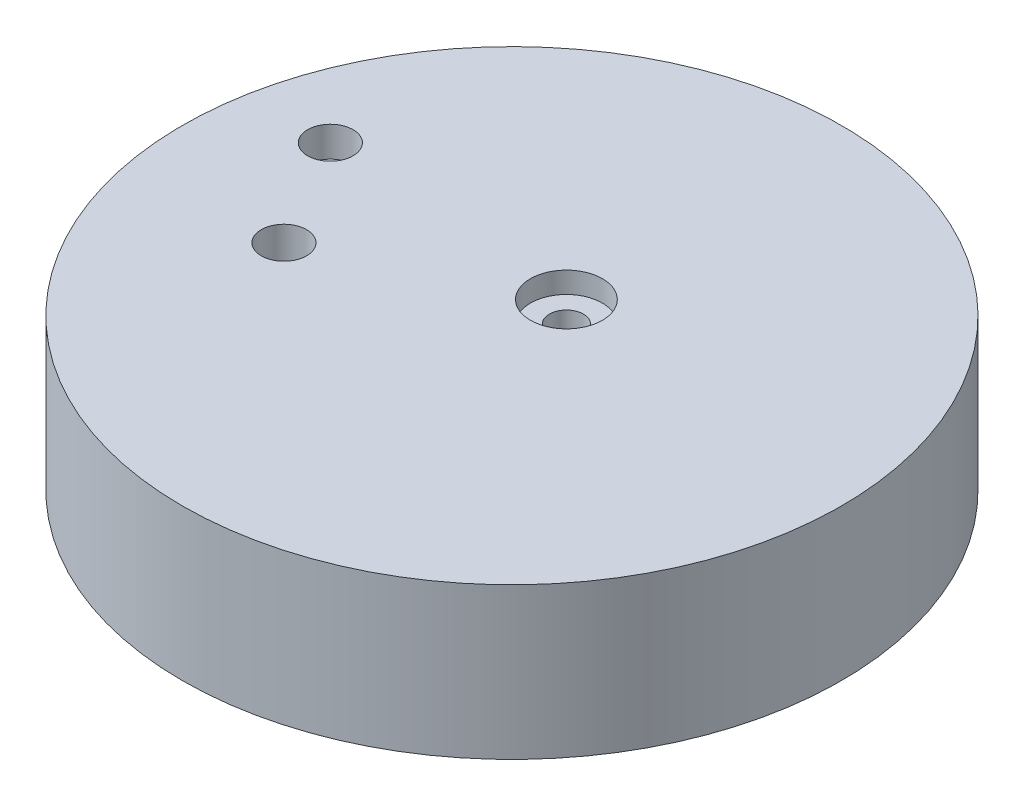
from build123d import *

# Parameters (mm, degrees)
SKETCH11_R                                           = 65.354799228
BOSS_EXTRUDE3_DEPTH                                  = 30
CBORE_FOR_1_4_BINDING_HEAD_MACHINE_SCREW_D           = 6.7564
CBORE_FOR_1_4_BINDING_HEAD_MACHINE_SCREW_CBORE_D     = 14.2875
CBORE_FOR_1_4_BINDING_HEAD_MACHINE_SCREW_CBORE_DEPTH = 4.191
M10X1_0_TAPPED_HOLE1_D                               = 9
M10X1_0_TAPPED_HOLE1_DEPTH                           = 6
M10X1_0_TAPPED_HOLE1_TIP                             = 2.703872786
M10X1_0_TAPPED_HOLE2_D                               = 9
M10X1_0_TAPPED_HOLE2_DEPTH                           = 23
M10X1_0_TAPPED_HOLE2_TIP                             = 2.703872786


with BuildPart() as part:
    # Sketch11 → Boss-Extrude3 (new body)
    with BuildSketch(Plane(origin=(0, 0, 0), x_dir=(1, 0, 0), z_dir=(0, 1, 0))):
        with Locations(Location((0, 0, 0), (0, 0, 270))):
            Circle(SKETCH11_R)
    extrude(amount=BOSS_EXTRUDE3_DEPTH)

    # CBORE for 1_4 Binding Head Machine Screw (through all)
    with Locations(Plane(origin=(2.617527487, 30, -8.185133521), x_dir=(0, 0, 1), z_dir=(0, 1, 0))):
        with Locations((0, 0)):
            CounterBoreHole(CBORE_FOR_1_4_BINDING_HEAD_MACHINE_SCREW_D / 2, CBORE_FOR_1_4_BINDING_HEAD_MACHINE_SCREW_CBORE_D / 2, CBORE_FOR_1_4_BINDING_HEAD_MACHINE_SCREW_CBORE_DEPTH)

    # M10x1.0 Tapped Hole1
    with Locations(Plane(origin=(0, 30, 0), x_dir=(1, 0, 0), z_dir=(0, 1, 0))):
        with Locations((-47.706428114, 11.697689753)):
            Hole(M10X1_0_TAPPED_HOLE1_D / 2, depth=M10X1_0_TAPPED_HOLE1_DEPTH)
            with Locations((0, 0, -(M10X1_0_TAPPED_HOLE1_DEPTH + M10X1_0_TAPPED_HOLE1_TIP / 2))):  # 118° drill point
                Cone(0, M10X1_0_TAPPED_HOLE1_D / 2, M10X1_0_TAPPED_HOLE1_TIP, mode=Mode.SUBTRACT)

    # M10x1.0 Tapped Hole2
    with Locations(Plane(origin=(0, 30, 0), x_dir=(1, 0, 0), z_dir=(0, 1, 0))):
        with Locations((-35.140034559, -10.077320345)):
            Hole(M10X1_0_TAPPED_HOLE2_D / 2, depth=M10X1_0_TAPPED_HOLE2_DEPTH)
            with Locations((0, 0, -(M10X1_0_TAPPED_HOLE2_DEPTH + M10X1_0_TAPPED_HOLE2_TIP / 2))):  # 118° drill point
                Cone(0, M10X1_0_TAPPED_HOLE2_D / 2, M10X1_0_TAPPED_HOLE2_TIP, mode=Mode.SUBTRACT)


solid = part.part
